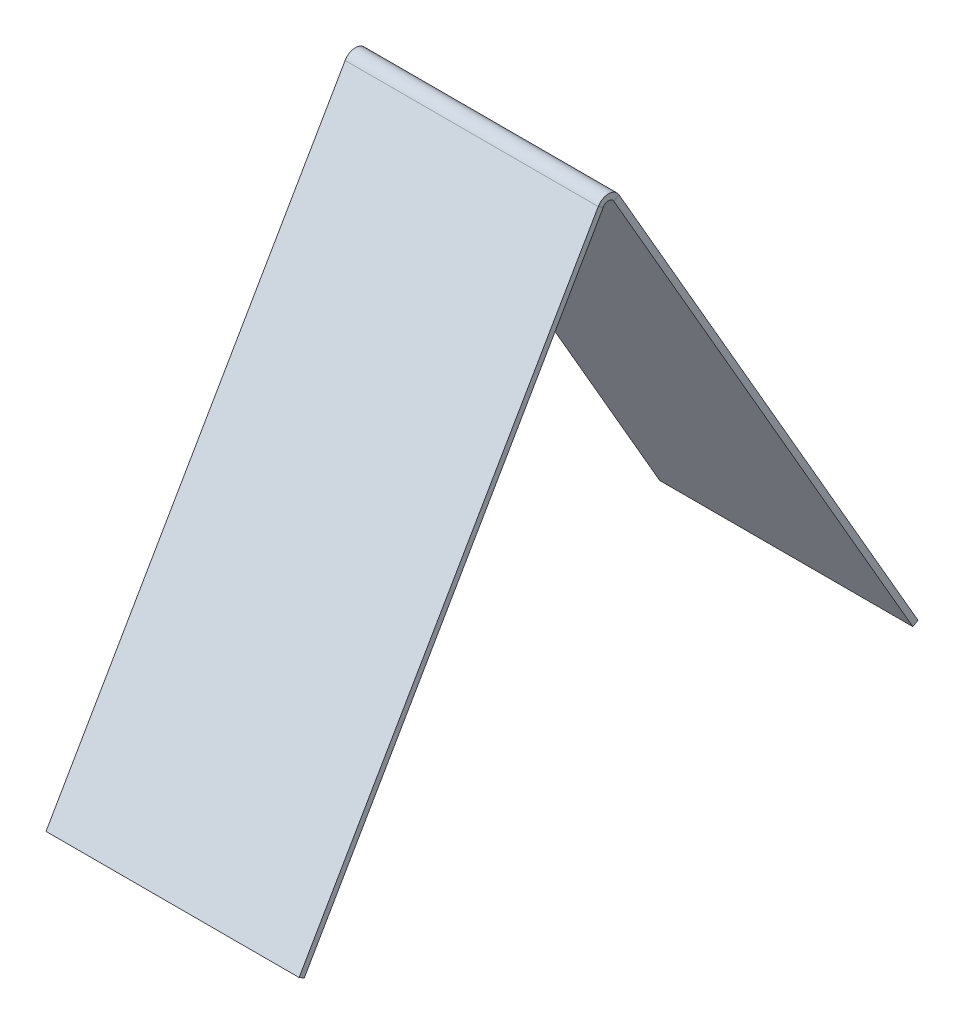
ISO-10303-21;
HEADER;
FILE_DESCRIPTION(('STEP AP214'),'2;1');
FILE_NAME('part.step','',(''),(''),'','','');
FILE_SCHEMA(('AUTOMOTIVE_DESIGN { 1 0 10303 214 1 1 1 1 }'));
ENDSEC;
DATA;
#1=APPLICATION_CONTEXT('core data for automotive mechanical design processes');
#2=APPLICATION_PROTOCOL_DEFINITION('international standard','automotive_design',2000,#1);
#3=PRODUCT_CONTEXT('',#1,'mechanical');
#4=PRODUCT('Part','Part','',(#3));
#5=PRODUCT_RELATED_PRODUCT_CATEGORY('part','',(#4));
#6=PRODUCT_DEFINITION_FORMATION('','',#4);
#7=PRODUCT_DEFINITION_CONTEXT('part definition',#1,'design');
#8=PRODUCT_DEFINITION('design','',#6,#7);
#9=PRODUCT_DEFINITION_SHAPE('','',#8);
#10=(LENGTH_UNIT() NAMED_UNIT(*) SI_UNIT(.MILLI.,.METRE.));
#11=(NAMED_UNIT(*) PLANE_ANGLE_UNIT() SI_UNIT($,.RADIAN.));
#12=(NAMED_UNIT(*) SI_UNIT($,.STERADIAN.) SOLID_ANGLE_UNIT());
#13=UNCERTAINTY_MEASURE_WITH_UNIT(LENGTH_MEASURE(1.E-05),#10,'distance_accuracy_value','');
#14=(GEOMETRIC_REPRESENTATION_CONTEXT(3) GLOBAL_UNCERTAINTY_ASSIGNED_CONTEXT((#13)) GLOBAL_UNIT_ASSIGNED_CONTEXT((#10,
#11,#12)) REPRESENTATION_CONTEXT('',''));
#15=CARTESIAN_POINT('',(0.,0.,0.));
#16=DIRECTION('',(0.,0.,1.));
#17=DIRECTION('',(1.,0.,0.));
#18=AXIS2_PLACEMENT_3D('',#15,#16,#17);
#19=CARTESIAN_POINT('',(42.5,174.,-3.46410161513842));
#20=DIRECTION('',(1.,0.,0.));
#21=DIRECTION('',(0.,0.,-1.));
#22=AXIS2_PLACEMENT_3D('',#19,#20,#21);
#23=PLANE('',#22);
#24=DIRECTION('',(0.,-0.5,0.866025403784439));
#25=VECTOR('',#24,1.);
#26=CARTESIAN_POINT('',(42.5,174.,-3.46410161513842));
#27=LINE('',#26,#25);
#28=CARTESIAN_POINT('',(42.5,174.,-3.46410161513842));
#29=VERTEX_POINT('',#28);
#30=CARTESIAN_POINT('',(42.5,173.,-1.73205080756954));
#31=VERTEX_POINT('',#30);
#32=EDGE_CURVE('E11',#29,#31,#27,.T.);
#33=ORIENTED_EDGE('',*,*,#32,.F.);
#34=CARTESIAN_POINT('',(42.5,172.,-6.22548887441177E-13));
#35=DIRECTION('',(1.,0.,0.));
#36=DIRECTION('',(0.,0.,-1.));
#37=AXIS2_PLACEMENT_3D('',#34,#35,#36);
#38=CIRCLE('',#37,4.);
#39=CARTESIAN_POINT('',(42.5,174.,3.46410161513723));
#40=VERTEX_POINT('',#39);
#41=EDGE_CURVE('E131',#40,#29,#38,.F.);
#42=ORIENTED_EDGE('',*,*,#41,.F.);
#43=DIRECTION('',(0.,0.499999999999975,0.866025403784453));
#44=VECTOR('',#43,1.);
#45=CARTESIAN_POINT('',(42.5,173.,1.73205080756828));
#46=LINE('',#45,#44);
#47=CARTESIAN_POINT('',(42.5,173.,1.73205080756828));
#48=VERTEX_POINT('',#47);
#49=EDGE_CURVE('E42',#48,#40,#46,.T.);
#50=ORIENTED_EDGE('',*,*,#49,.F.);
#51=CARTESIAN_POINT('',(42.5,172.,-6.22548887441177E-13));
#52=DIRECTION('',(1.,0.,0.));
#53=DIRECTION('',(0.,0.,-1.));
#54=AXIS2_PLACEMENT_3D('',#51,#52,#53);
#55=CIRCLE('',#54,2.);
#56=EDGE_CURVE('E124',#48,#31,#55,.F.);
#57=ORIENTED_EDGE('',*,*,#56,.T.);
#58=EDGE_LOOP('',(#33,#42,#50,#57));
#59=FACE_BOUND('',#58,.T.);
#60=ADVANCED_FACE('F34',(#59),#23,.T.);
#61=CARTESIAN_POINT('',(42.5,173.,1.73205080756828));
#62=DIRECTION('',(1.,0.,0.));
#63=DIRECTION('',(0.,0.,-1.));
#64=AXIS2_PLACEMENT_3D('',#61,#62,#63);
#65=PLANE('',#64);
#66=DIRECTION('',(0.,-0.86602540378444,-0.499999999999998));
#67=VECTOR('',#66,1.);
#68=CARTESIAN_POINT('',(42.5,180.,-6.28466640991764E-13));
#69=LINE('',#68,#67);
#70=CARTESIAN_POINT('',(42.5,0.,-103.923048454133));
#71=VERTEX_POINT('',#70);
#72=EDGE_CURVE('E180',#29,#71,#69,.T.);
#73=ORIENTED_EDGE('',*,*,#72,.F.);
#74=ORIENTED_EDGE('',*,*,#32,.T.);
#75=DIRECTION('',(0.,-0.86602540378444,-0.499999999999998));
#76=VECTOR('',#75,1.);
#77=CARTESIAN_POINT('',(42.5,179.,1.73205080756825));
#78=LINE('',#77,#76);
#79=CARTESIAN_POINT('',(42.5,-1.00000000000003,-102.190997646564));
#80=VERTEX_POINT('',#79);
#81=EDGE_CURVE('E90',#31,#80,#78,.T.);
#82=ORIENTED_EDGE('',*,*,#81,.T.);
#83=DIRECTION('',(0.,-0.500000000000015,0.86602540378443));
#84=VECTOR('',#83,1.);
#85=CARTESIAN_POINT('',(42.5,0.,-103.923048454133));
#86=LINE('',#85,#84);
#87=EDGE_CURVE('E337',#71,#80,#86,.T.);
#88=ORIENTED_EDGE('',*,*,#87,.F.);
#89=EDGE_LOOP('',(#73,#74,#82,#88));
#90=FACE_BOUND('',#89,.T.);
#91=ADVANCED_FACE('F188',(#90),#65,.T.);
#92=CARTESIAN_POINT('',(-42.5,174.,3.46410161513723));
#93=DIRECTION('',(-1.,0.,0.));
#94=DIRECTION('',(0.,0.,1.));
#95=AXIS2_PLACEMENT_3D('',#92,#93,#94);
#96=PLANE('',#95);
#97=DIRECTION('',(0.,-0.499999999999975,-0.866025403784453));
#98=VECTOR('',#97,1.);
#99=CARTESIAN_POINT('',(-42.5,174.,3.46410161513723));
#100=LINE('',#99,#98);
#101=CARTESIAN_POINT('',(-42.5,174.,3.46410161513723));
#102=VERTEX_POINT('',#101);
#103=CARTESIAN_POINT('',(-42.5,173.,1.73205080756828));
#104=VERTEX_POINT('',#103);
#105=EDGE_CURVE('E77',#102,#104,#100,.T.);
#106=ORIENTED_EDGE('',*,*,#105,.F.);
#107=CARTESIAN_POINT('',(-42.5,172.,-6.22548887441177E-13));
#108=DIRECTION('',(1.,0.,0.));
#109=DIRECTION('',(0.,0.,-1.));
#110=AXIS2_PLACEMENT_3D('',#107,#108,#109);
#111=CIRCLE('',#110,4.);
#112=CARTESIAN_POINT('',(-42.5,174.,-3.46410161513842));
#113=VERTEX_POINT('',#112);
#114=EDGE_CURVE('E146',#102,#113,#111,.F.);
#115=ORIENTED_EDGE('',*,*,#114,.T.);
#116=DIRECTION('',(0.,0.5,-0.866025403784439));
#117=VECTOR('',#116,1.);
#118=CARTESIAN_POINT('',(-42.5,173.,-1.73205080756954));
#119=LINE('',#118,#117);
#120=CARTESIAN_POINT('',(-42.5,173.,-1.73205080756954));
#121=VERTEX_POINT('',#120);
#122=EDGE_CURVE('E84',#121,#113,#119,.T.);
#123=ORIENTED_EDGE('',*,*,#122,.F.);
#124=CARTESIAN_POINT('',(-42.5,172.,-6.22548887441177E-13));
#125=DIRECTION('',(1.,0.,0.));
#126=DIRECTION('',(0.,0.,-1.));
#127=AXIS2_PLACEMENT_3D('',#124,#125,#126);
#128=CIRCLE('',#127,2.);
#129=EDGE_CURVE('E153',#104,#121,#128,.F.);
#130=ORIENTED_EDGE('',*,*,#129,.F.);
#131=EDGE_LOOP('',(#106,#115,#123,#130));
#132=FACE_BOUND('',#131,.T.);
#133=ADVANCED_FACE('F186',(#132),#96,.T.);
#134=CARTESIAN_POINT('',(-42.5,173.,-1.73205080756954));
#135=DIRECTION('',(-1.,0.,0.));
#136=DIRECTION('',(0.,0.,1.));
#137=AXIS2_PLACEMENT_3D('',#134,#135,#136);
#138=PLANE('',#137);
#139=DIRECTION('',(0.,0.86602540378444,-0.499999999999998));
#140=VECTOR('',#139,1.);
#141=CARTESIAN_POINT('',(-42.5,0.,103.923048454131));
#142=LINE('',#141,#140);
#143=CARTESIAN_POINT('',(-42.5,0.,103.923048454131));
#144=VERTEX_POINT('',#143);
#145=EDGE_CURVE('E148',#144,#102,#142,.T.);
#146=ORIENTED_EDGE('',*,*,#145,.T.);
#147=ORIENTED_EDGE('',*,*,#105,.T.);
#148=DIRECTION('',(0.,0.86602540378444,-0.499999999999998));
#149=VECTOR('',#148,1.);
#150=CARTESIAN_POINT('',(-42.5,-0.999999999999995,102.190997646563));
#151=LINE('',#150,#149);
#152=CARTESIAN_POINT('',(-42.5,-0.999999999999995,102.190997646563));
#153=VERTEX_POINT('',#152);
#154=EDGE_CURVE('E151',#153,#104,#151,.T.);
#155=ORIENTED_EDGE('',*,*,#154,.F.);
#156=DIRECTION('',(0.,0.499999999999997,0.866025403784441));
#157=VECTOR('',#156,1.);
#158=CARTESIAN_POINT('',(-42.5,-0.999999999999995,102.190997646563));
#159=LINE('',#158,#157);
#160=EDGE_CURVE('E112',#153,#144,#159,.T.);
#161=ORIENTED_EDGE('',*,*,#160,.T.);
#162=EDGE_LOOP('',(#146,#147,#155,#161));
#163=FACE_BOUND('',#162,.T.);
#164=ADVANCED_FACE('F182',(#163),#138,.T.);
#165=CARTESIAN_POINT('',(42.5,179.,1.73205080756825));
#166=DIRECTION('',(0.,0.499999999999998,-0.86602540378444));
#167=DIRECTION('',(0.,0.86602540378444,0.499999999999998));
#168=AXIS2_PLACEMENT_3D('',#165,#166,#167);
#169=PLANE('',#168);
#170=DIRECTION('',(0.,-0.86602540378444,-0.499999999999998));
#171=VECTOR('',#170,1.);
#172=CARTESIAN_POINT('',(-42.5,179.,1.73205080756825));
#173=LINE('',#172,#171);
#174=CARTESIAN_POINT('',(-42.5,-1.00000000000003,-102.190997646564));
#175=VERTEX_POINT('',#174);
#176=EDGE_CURVE('E137',#121,#175,#173,.T.);
#177=ORIENTED_EDGE('',*,*,#176,.T.);
#178=DIRECTION('',(-1.,0.,0.));
#179=VECTOR('',#178,1.);
#180=CARTESIAN_POINT('',(42.5,-1.00000000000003,-102.190997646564));
#181=LINE('',#180,#179);
#182=EDGE_CURVE('E167',#80,#175,#181,.T.);
#183=ORIENTED_EDGE('',*,*,#182,.F.);
#184=ORIENTED_EDGE('',*,*,#81,.F.);
#185=DIRECTION('',(-1.,0.,0.));
#186=VECTOR('',#185,1.);
#187=CARTESIAN_POINT('',(42.5,173.,-1.73205080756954));
#188=LINE('',#187,#186);
#189=EDGE_CURVE('E136',#31,#121,#188,.T.);
#190=ORIENTED_EDGE('',*,*,#189,.T.);
#191=EDGE_LOOP('',(#177,#183,#184,#190));
#192=FACE_BOUND('',#191,.T.);
#193=ADVANCED_FACE('F194',(#192),#169,.F.);
#194=CARTESIAN_POINT('',(42.5,0.,-103.923048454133));
#195=DIRECTION('',(0.,-0.86602540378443,-0.500000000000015));
#196=DIRECTION('',(0.,0.500000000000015,-0.86602540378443));
#197=AXIS2_PLACEMENT_3D('',#194,#195,#196);
#198=PLANE('',#197);
#199=DIRECTION('',(0.,-0.500000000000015,0.86602540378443));
#200=VECTOR('',#199,1.);
#201=CARTESIAN_POINT('',(-42.5,0.,-103.923048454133));
#202=LINE('',#201,#200);
#203=CARTESIAN_POINT('',(-42.5,0.,-103.923048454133));
#204=VERTEX_POINT('',#203);
#205=EDGE_CURVE('E140',#204,#175,#202,.T.);
#206=ORIENTED_EDGE('',*,*,#205,.F.);
#207=DIRECTION('',(-1.,0.,0.));
#208=VECTOR('',#207,1.);
#209=CARTESIAN_POINT('',(42.5,0.,-103.923048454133));
#210=LINE('',#209,#208);
#211=EDGE_CURVE('E165',#71,#204,#210,.T.);
#212=ORIENTED_EDGE('',*,*,#211,.F.);
#213=ORIENTED_EDGE('',*,*,#87,.T.);
#214=ORIENTED_EDGE('',*,*,#182,.T.);
#215=EDGE_LOOP('',(#206,#212,#213,#214));
#216=FACE_BOUND('',#215,.T.);
#217=ADVANCED_FACE('F225',(#216),#198,.T.);
#218=CARTESIAN_POINT('',(42.5,180.,-6.28466640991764E-13));
#219=DIRECTION('',(0.,0.499999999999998,-0.86602540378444));
#220=DIRECTION('',(0.,0.86602540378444,0.499999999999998));
#221=AXIS2_PLACEMENT_3D('',#218,#219,#220);
#222=PLANE('',#221);
#223=DIRECTION('',(0.,-0.86602540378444,-0.499999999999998));
#224=VECTOR('',#223,1.);
#225=CARTESIAN_POINT('',(-42.5,180.,-6.28466640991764E-13));
#226=LINE('',#225,#224);
#227=EDGE_CURVE('E143',#113,#204,#226,.T.);
#228=ORIENTED_EDGE('',*,*,#227,.F.);
#229=DIRECTION('',(-1.,0.,0.));
#230=VECTOR('',#229,1.);
#231=CARTESIAN_POINT('',(42.5,174.,-3.46410161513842));
#232=LINE('',#231,#230);
#233=EDGE_CURVE('E162',#29,#113,#232,.T.);
#234=ORIENTED_EDGE('',*,*,#233,.F.);
#235=ORIENTED_EDGE('',*,*,#72,.T.);
#236=ORIENTED_EDGE('',*,*,#211,.T.);
#237=EDGE_LOOP('',(#228,#234,#235,#236));
#238=FACE_BOUND('',#237,.T.);
#239=ADVANCED_FACE('F236',(#238),#222,.T.);
#240=CARTESIAN_POINT('',(42.5,172.,-6.22548887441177E-13));
#241=DIRECTION('',(-1.,0.,0.));
#242=DIRECTION('',(0.,0.,1.));
#243=AXIS2_PLACEMENT_3D('',#240,#241,#242);
#244=CYLINDRICAL_SURFACE('',#243,4.);
#245=ORIENTED_EDGE('',*,*,#114,.F.);
#246=DIRECTION('',(-1.,0.,0.));
#247=VECTOR('',#246,1.);
#248=CARTESIAN_POINT('',(42.5,174.,3.46410161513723));
#249=LINE('',#248,#247);
#250=EDGE_CURVE('E159',#40,#102,#249,.T.);
#251=ORIENTED_EDGE('',*,*,#250,.F.);
#252=ORIENTED_EDGE('',*,*,#41,.T.);
#253=ORIENTED_EDGE('',*,*,#233,.T.);
#254=EDGE_LOOP('',(#245,#251,#252,#253));
#255=FACE_BOUND('',#254,.T.);
#256=ADVANCED_FACE('F176',(#255),#244,.T.);
#257=CARTESIAN_POINT('',(42.5,0.,103.923048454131));
#258=DIRECTION('',(0.,0.499999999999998,0.86602540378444));
#259=DIRECTION('',(0.,-0.86602540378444,0.499999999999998));
#260=AXIS2_PLACEMENT_3D('',#257,#258,#259);
#261=PLANE('',#260);
#262=ORIENTED_EDGE('',*,*,#145,.F.);
#263=DIRECTION('',(-1.,0.,0.));
#264=VECTOR('',#263,1.);
#265=CARTESIAN_POINT('',(42.5,0.,103.923048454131));
#266=LINE('',#265,#264);
#267=CARTESIAN_POINT('',(42.5,0.,103.923048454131));
#268=VERTEX_POINT('',#267);
#269=EDGE_CURVE('E114',#268,#144,#266,.T.);
#270=ORIENTED_EDGE('',*,*,#269,.F.);
#271=DIRECTION('',(0.,0.86602540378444,-0.499999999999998));
#272=VECTOR('',#271,1.);
#273=CARTESIAN_POINT('',(42.5,0.,103.923048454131));
#274=LINE('',#273,#272);
#275=EDGE_CURVE('E129',#268,#40,#274,.T.);
#276=ORIENTED_EDGE('',*,*,#275,.T.);
#277=ORIENTED_EDGE('',*,*,#250,.T.);
#278=EDGE_LOOP('',(#262,#270,#276,#277));
#279=FACE_BOUND('',#278,.T.);
#280=ADVANCED_FACE('F181',(#279),#261,.T.);
#281=CARTESIAN_POINT('',(42.5,-0.999999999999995,102.190997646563));
#282=DIRECTION('',(0.,-0.866025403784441,0.499999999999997));
#283=DIRECTION('',(0.,-0.499999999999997,-0.866025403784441));
#284=AXIS2_PLACEMENT_3D('',#281,#282,#283);
#285=PLANE('',#284);
#286=ORIENTED_EDGE('',*,*,#160,.F.);
#287=DIRECTION('',(-1.,0.,0.));
#288=VECTOR('',#287,1.);
#289=CARTESIAN_POINT('',(42.5,-0.999999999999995,102.190997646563));
#290=LINE('',#289,#288);
#291=CARTESIAN_POINT('',(42.5,-0.999999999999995,102.190997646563));
#292=VERTEX_POINT('',#291);
#293=EDGE_CURVE('E106',#292,#153,#290,.T.);
#294=ORIENTED_EDGE('',*,*,#293,.F.);
#295=DIRECTION('',(0.,0.499999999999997,0.866025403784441));
#296=VECTOR('',#295,1.);
#297=CARTESIAN_POINT('',(42.5,-0.999999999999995,102.190997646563));
#298=LINE('',#297,#296);
#299=EDGE_CURVE('E110',#292,#268,#298,.T.);
#300=ORIENTED_EDGE('',*,*,#299,.T.);
#301=ORIENTED_EDGE('',*,*,#269,.T.);
#302=EDGE_LOOP('',(#286,#294,#300,#301));
#303=FACE_BOUND('',#302,.T.);
#304=ADVANCED_FACE('F108',(#303),#285,.T.);
#305=CARTESIAN_POINT('',(42.5,-0.999999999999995,102.190997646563));
#306=DIRECTION('',(0.,0.499999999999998,0.86602540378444));
#307=DIRECTION('',(0.,-0.86602540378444,0.499999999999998));
#308=AXIS2_PLACEMENT_3D('',#305,#306,#307);
#309=PLANE('',#308);
#310=ORIENTED_EDGE('',*,*,#154,.T.);
#311=DIRECTION('',(-1.,0.,0.));
#312=VECTOR('',#311,1.);
#313=CARTESIAN_POINT('',(42.5,173.,1.73205080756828));
#314=LINE('',#313,#312);
#315=EDGE_CURVE('E115',#48,#104,#314,.T.);
#316=ORIENTED_EDGE('',*,*,#315,.F.);
#317=DIRECTION('',(0.,0.86602540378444,-0.499999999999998));
#318=VECTOR('',#317,1.);
#319=CARTESIAN_POINT('',(42.5,-0.999999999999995,102.190997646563));
#320=LINE('',#319,#318);
#321=EDGE_CURVE('E119',#292,#48,#320,.T.);
#322=ORIENTED_EDGE('',*,*,#321,.F.);
#323=ORIENTED_EDGE('',*,*,#293,.T.);
#324=EDGE_LOOP('',(#310,#316,#322,#323));
#325=FACE_BOUND('',#324,.T.);
#326=ADVANCED_FACE('F120',(#325),#309,.F.);
#327=CARTESIAN_POINT('',(42.5,172.,-6.22548887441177E-13));
#328=DIRECTION('',(-1.,0.,0.));
#329=DIRECTION('',(0.,0.,1.));
#330=AXIS2_PLACEMENT_3D('',#327,#328,#329);
#331=CYLINDRICAL_SURFACE('',#330,2.);
#332=ORIENTED_EDGE('',*,*,#129,.T.);
#333=ORIENTED_EDGE('',*,*,#189,.F.);
#334=ORIENTED_EDGE('',*,*,#56,.F.);
#335=ORIENTED_EDGE('',*,*,#315,.T.);
#336=EDGE_LOOP('',(#332,#333,#334,#335));
#337=FACE_BOUND('',#336,.T.);
#338=ADVANCED_FACE('F184',(#337),#331,.F.);
#339=CARTESIAN_POINT('',(42.5,172.,-6.22548887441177E-13));
#340=DIRECTION('',(1.,0.,0.));
#341=DIRECTION('',(0.,0.,-1.));
#342=AXIS2_PLACEMENT_3D('',#339,#340,#341);
#343=PLANE('',#342);
#344=ORIENTED_EDGE('',*,*,#321,.T.);
#345=ORIENTED_EDGE('',*,*,#49,.T.);
#346=ORIENTED_EDGE('',*,*,#275,.F.);
#347=ORIENTED_EDGE('',*,*,#299,.F.);
#348=EDGE_LOOP('',(#344,#345,#346,#347));
#349=FACE_BOUND('',#348,.T.);
#350=ADVANCED_FACE('F127',(#349),#343,.T.);
#351=CARTESIAN_POINT('',(-42.5,172.,-6.22548887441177E-13));
#352=DIRECTION('',(1.,0.,0.));
#353=DIRECTION('',(0.,0.,-1.));
#354=AXIS2_PLACEMENT_3D('',#351,#352,#353);
#355=PLANE('',#354);
#356=ORIENTED_EDGE('',*,*,#176,.F.);
#357=ORIENTED_EDGE('',*,*,#122,.T.);
#358=ORIENTED_EDGE('',*,*,#227,.T.);
#359=ORIENTED_EDGE('',*,*,#205,.T.);
#360=EDGE_LOOP('',(#356,#357,#358,#359));
#361=FACE_BOUND('',#360,.T.);
#362=ADVANCED_FACE('F302',(#361),#355,.F.);
#363=CLOSED_SHELL('',(#60,#91,#133,#164,#193,#217,#239,#256,#280,#304,#326,#338,#350,#362));
#364=MANIFOLD_SOLID_BREP('B2',#363);
#365=ADVANCED_BREP_SHAPE_REPRESENTATION('',(#18,#364),#14);
#366=SHAPE_DEFINITION_REPRESENTATION(#9,#365);
ENDSEC;
END-ISO-10303-21;
